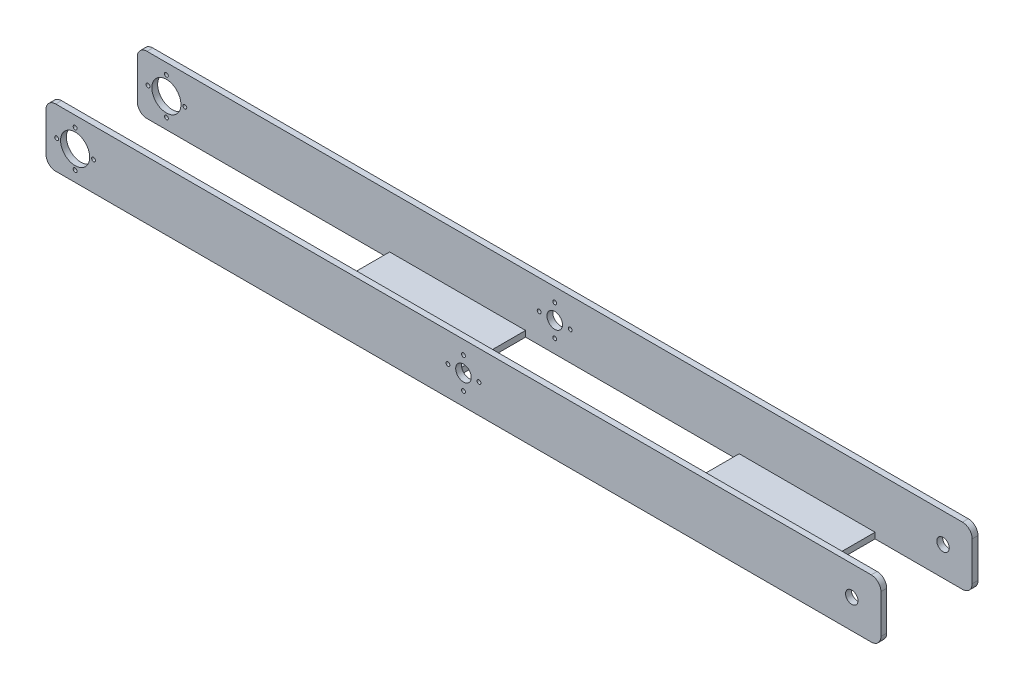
from build123d import *

# Parameters (mm, degrees)
SKETCH1_W           = 430
SKETCH1_H           = 30
BOSS_EXTRUDE1_DEPTH = 50
SHELL3_T            = -3
CUT_EXTRUDE7_REACH  = 224.383
SKETCH2_W           = 110
SKETCH2_H           = 44
SKETCH2_W_2         = 50
SKETCH2_W_3         = 130
SKETCH3_R           = 4
SKETCH3_R_2         = 1
SKETCH3_R_3         = 7.5
SKETCH3_R_4         = 3.2
CUT_EXTRUDE2_DEPTH  = 222.246468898
FILLET1_R           = 5


with BuildPart() as part:
    # Sketch1 → Boss-Extrude1 (new body)
    with BuildSketch(Plane.XY):
        Rectangle(SKETCH1_W, SKETCH1_H)
    extrude(amount=BOSS_EXTRUDE1_DEPTH)

    # Shell3
    shell3_openings = [part.faces().sort_by_distance(p)[0] for p in [
        (-215, 0, 25),
        (0, 15, 25),
        (215, 0, 25),
    ]]
    offset(amount=SHELL3_T, openings=shell3_openings, kind=Kind.INTERSECTION)

    # Sketch2 → Cut-Extrude7 (cut, up to next)
    with BuildSketch(Plane(origin=(0, -12, 0), x_dir=(1, 0, 0), z_dir=(0, 1, 0)), mode=Mode.PRIVATE) as cut_extrude7_sk1:
        with Locations((40, -25)):
            Rectangle(SKETCH2_W, SKETCH2_H)
    cut_extrude7_tool1 = extrude(cut_extrude7_sk1.sketch, amount=-CUT_EXTRUDE7_REACH, mode=Mode.PRIVATE) & part.part
    # Sketch2 → Cut-Extrude7 (cut, up to next)
    with BuildSketch(Plane(origin=(0, -12, 0), x_dir=(1, 0, 0), z_dir=(0, 1, 0)), mode=Mode.PRIVATE) as cut_extrude7_sk2:
        with Locations((190, -25)):
            Rectangle(SKETCH2_W_2, SKETCH2_H)
    cut_extrude7_tool2 = extrude(cut_extrude7_sk2.sketch, amount=-CUT_EXTRUDE7_REACH, mode=Mode.PRIVATE) & part.part
    # Sketch2 → Cut-Extrude7 (cut, up to next)
    with BuildSketch(Plane(origin=(0, -12, 0), x_dir=(1, 0, 0), z_dir=(0, 1, 0)), mode=Mode.PRIVATE) as cut_extrude7_sk3:
        with Locations((-150, -25)):
            Rectangle(SKETCH2_W_3, SKETCH2_H)
    cut_extrude7_tool3 = extrude(cut_extrude7_sk3.sketch, amount=-CUT_EXTRUDE7_REACH, mode=Mode.PRIVATE) & part.part
    add(cut_extrude7_tool1.solids().sort_by_distance((40, -12, 25))[0], mode=Mode.SUBTRACT)
    add(cut_extrude7_tool2.solids().sort_by_distance((190, -12, 25))[0], mode=Mode.SUBTRACT)
    add(cut_extrude7_tool3.solids().sort_by_distance((-150, -12, 25))[0], mode=Mode.SUBTRACT)

    # Sketch3 → Cut-Extrude2 (cut, through all)
    with BuildSketch(Plane(origin=(0, 0, 0), x_dir=(-1, 0, 0), z_dir=(0, 0, -1))):
        Circle(SKETCH3_R)
        with Locations((0, 8)):
            Circle(SKETCH3_R_2)
        with Locations((0, -8)):
            Circle(SKETCH3_R_2)
        with Locations((8, 0)):
            Circle(SKETCH3_R_2)
        with Locations((-8, 0)):
            Circle(SKETCH3_R_2)
        with Locations((200, 0)):
            Circle(SKETCH3_R_3)
        with Locations((-200, 0)):
            Circle(SKETCH3_R_4)
        with Locations((200, 9.5)):
            Circle(SKETCH3_R_2)
        with Locations((209.5, 0)):
            Circle(SKETCH3_R_2)
        with Locations((190.5, 0)):
            Circle(SKETCH3_R_2)
        with Locations((200, -9.5)):
            Circle(SKETCH3_R_2)
    extrude(amount=-CUT_EXTRUDE2_DEPTH, mode=Mode.SUBTRACT)

    # Fillet1
    fillet1_edges = [part.edges().sort_by_distance(p)[0] for p in [
        (-215, 15, 1.5),
        (215, 15, 1.5),
        (215, -15, 1.5),
        (-215, -15, 1.5),
        (215, -15, 48.5),
        (-215, -15, 48.5),
        (-215, 15, 48.5),
        (215, 15, 48.5),
    ]]
    fillet(fillet1_edges, radius=FILLET1_R)


solid = part.part
